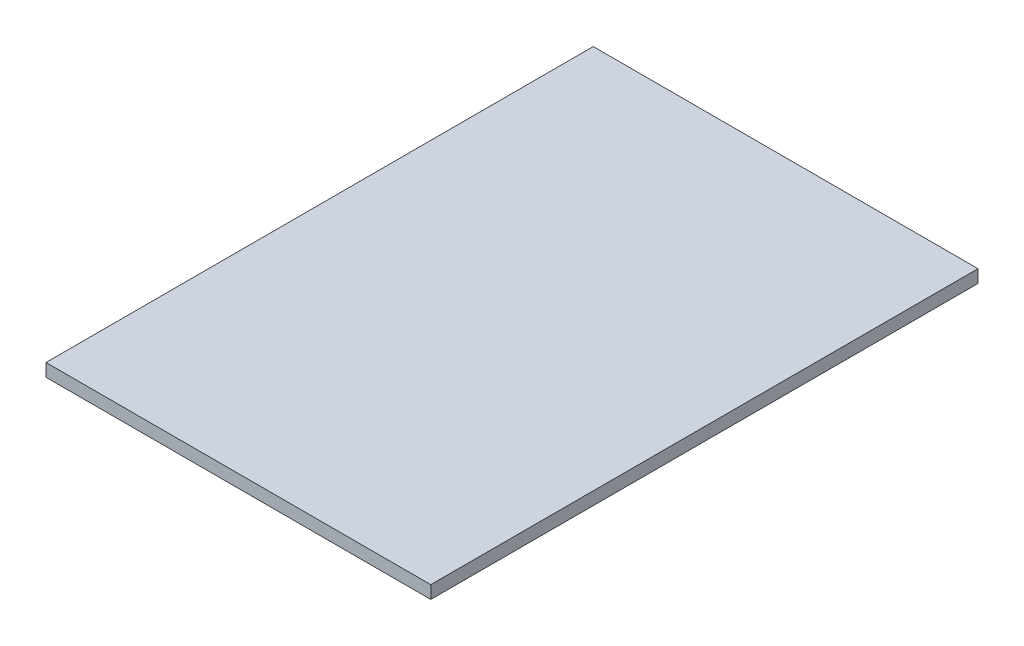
from build123d import *

# Parameters (mm, degrees)
SKETCH1_W           = 142.875
SKETCH1_H           = 203.2
BOSS_EXTRUDE1_DEPTH = 4.7625


with BuildPart() as part:
    # Sketch1 → Boss-Extrude1 (new body)
    with BuildSketch(Plane(origin=(0, 0, 0), x_dir=(1, 0, 0), z_dir=(0, 1, 0))):
        with Locations((71.4375, 101.6)):
            Rectangle(SKETCH1_W, SKETCH1_H)
    extrude(amount=BOSS_EXTRUDE1_DEPTH)


solid = part.part
